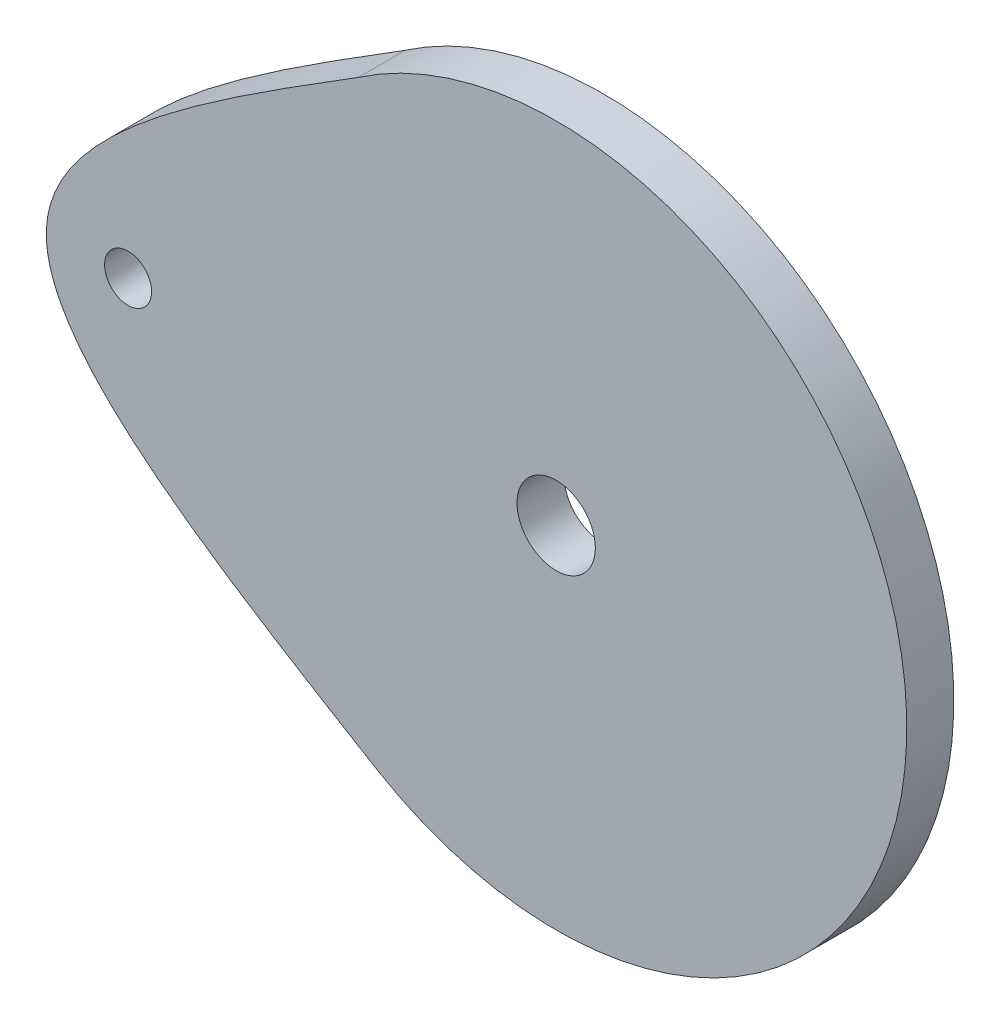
from build123d import *

# Parameters (mm, degrees)
ESQUISSE1_R      = 2.5
ESQUISSE1_R_2    = 1.5
EXTRUSION1_DEPTH = 3


with BuildPart() as part:
    # Esquisse1 → Extrusion1 (new body)
    with BuildSketch(Plane.XY):
        with BuildLine():
            ThreePointArc((-11.255443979, -19.32096681), (22.364187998, 0.81286055), (-12.629422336, 18.450827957))
            add(Edge.make_bspline(
                [(-12.629422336, 18.450827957), (-22.504946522, 12.283895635), (-42.838352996, -0.413632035), (-21.982190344, -12.899323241), (-11.255443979, -19.32096681)],
                knots=[0, 0, 0, 0, 0.48567977, 1, 1, 1, 1], degree=3))
        make_face()
        Circle(ESQUISSE1_R, mode=Mode.SUBTRACT)
        with Locations((-27.32, 0)):
            Circle(ESQUISSE1_R_2, mode=Mode.SUBTRACT)
    extrude(amount=EXTRUSION1_DEPTH)


solid = part.part
